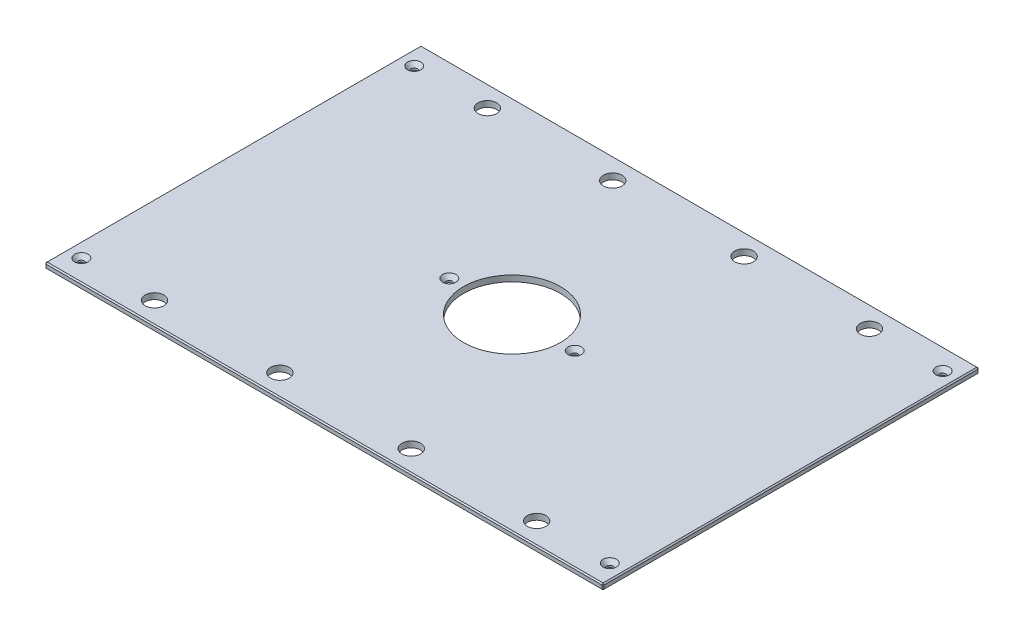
ISO-10303-21;
HEADER;
FILE_DESCRIPTION(('STEP AP214'),'2;1');
FILE_NAME('part.step','',(''),(''),'','','');
FILE_SCHEMA(('AUTOMOTIVE_DESIGN { 1 0 10303 214 1 1 1 1 }'));
ENDSEC;
DATA;
#1=APPLICATION_CONTEXT('core data for automotive mechanical design processes');
#2=APPLICATION_PROTOCOL_DEFINITION('international standard','automotive_design',2000,#1);
#3=PRODUCT_CONTEXT('',#1,'mechanical');
#4=PRODUCT('Part','Part','',(#3));
#5=PRODUCT_RELATED_PRODUCT_CATEGORY('part','',(#4));
#6=PRODUCT_DEFINITION_FORMATION('','',#4);
#7=PRODUCT_DEFINITION_CONTEXT('part definition',#1,'design');
#8=PRODUCT_DEFINITION('design','',#6,#7);
#9=PRODUCT_DEFINITION_SHAPE('','',#8);
#10=(LENGTH_UNIT() NAMED_UNIT(*) SI_UNIT(.MILLI.,.METRE.));
#11=(NAMED_UNIT(*) PLANE_ANGLE_UNIT() SI_UNIT($,.RADIAN.));
#12=(NAMED_UNIT(*) SI_UNIT($,.STERADIAN.) SOLID_ANGLE_UNIT());
#13=UNCERTAINTY_MEASURE_WITH_UNIT(LENGTH_MEASURE(1.E-05),#10,'distance_accuracy_value','');
#14=(GEOMETRIC_REPRESENTATION_CONTEXT(3) GLOBAL_UNCERTAINTY_ASSIGNED_CONTEXT((#13)) GLOBAL_UNIT_ASSIGNED_CONTEXT((#10,
#11,#12)) REPRESENTATION_CONTEXT('',''));
#15=CARTESIAN_POINT('',(0.,0.,0.));
#16=DIRECTION('',(0.,0.,1.));
#17=DIRECTION('',(1.,0.,0.));
#18=AXIS2_PLACEMENT_3D('',#15,#16,#17);
#19=CARTESIAN_POINT('',(-296.8625,6.35,-200.025));
#20=DIRECTION('',(1.,0.,0.));
#21=DIRECTION('',(0.,0.,-1.));
#22=AXIS2_PLACEMENT_3D('',#19,#20,#21);
#23=PLANE('',#22);
#24=DIRECTION('',(0.,0.,-1.));
#25=VECTOR('',#24,1.);
#26=CARTESIAN_POINT('',(-296.8625,5.08000000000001,-200.025));
#27=LINE('',#26,#25);
#28=CARTESIAN_POINT('',(-296.8625,5.08000000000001,198.755));
#29=VERTEX_POINT('',#28);
#30=CARTESIAN_POINT('',(-296.8625,5.08000000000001,-198.755));
#31=VERTEX_POINT('',#30);
#32=EDGE_CURVE('E135',#29,#31,#27,.T.);
#33=ORIENTED_EDGE('',*,*,#32,.T.);
#34=DIRECTION('',(0.,-1.,0.));
#35=VECTOR('',#34,1.);
#36=CARTESIAN_POINT('',(-296.8625,6.35,-198.755));
#37=LINE('',#36,#35);
#38=CARTESIAN_POINT('',(-296.8625,1.26999999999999,-198.755));
#39=VERTEX_POINT('',#38);
#40=EDGE_CURVE('E131',#31,#39,#37,.T.);
#41=ORIENTED_EDGE('',*,*,#40,.T.);
#42=DIRECTION('',(0.,0.,1.));
#43=VECTOR('',#42,1.);
#44=CARTESIAN_POINT('',(-296.8625,1.26999999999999,-200.025));
#45=LINE('',#44,#43);
#46=CARTESIAN_POINT('',(-296.8625,1.26999999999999,198.755));
#47=VERTEX_POINT('',#46);
#48=EDGE_CURVE('E126',#39,#47,#45,.T.);
#49=ORIENTED_EDGE('',*,*,#48,.T.);
#50=DIRECTION('',(0.,1.,0.));
#51=VECTOR('',#50,1.);
#52=CARTESIAN_POINT('',(-296.8625,6.35,198.755));
#53=LINE('',#52,#51);
#54=EDGE_CURVE('E128',#47,#29,#53,.T.);
#55=ORIENTED_EDGE('',*,*,#54,.T.);
#56=EDGE_LOOP('',(#33,#41,#49,#55));
#57=FACE_BOUND('',#56,.T.);
#58=ADVANCED_FACE('F35',(#57),#23,.F.);
#59=CARTESIAN_POINT('',(-296.8625,6.35,200.025));
#60=DIRECTION('',(0.,0.,-1.));
#61=DIRECTION('',(-1.,0.,0.));
#62=AXIS2_PLACEMENT_3D('',#59,#60,#61);
#63=PLANE('',#62);
#64=DIRECTION('',(1.,0.,0.));
#65=VECTOR('',#64,1.);
#66=CARTESIAN_POINT('',(-296.8625,1.26999999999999,200.025));
#67=LINE('',#66,#65);
#68=CARTESIAN_POINT('',(-295.5925,1.26999999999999,200.025));
#69=VERTEX_POINT('',#68);
#70=CARTESIAN_POINT('',(295.5925,1.26999999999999,200.025));
#71=VERTEX_POINT('',#70);
#72=EDGE_CURVE('E58',#69,#71,#67,.T.);
#73=ORIENTED_EDGE('',*,*,#72,.T.);
#74=DIRECTION('',(0.,1.,0.));
#75=VECTOR('',#74,1.);
#76=CARTESIAN_POINT('',(295.5925,6.35,200.025));
#77=LINE('',#76,#75);
#78=CARTESIAN_POINT('',(295.5925,5.08000000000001,200.025));
#79=VERTEX_POINT('',#78);
#80=EDGE_CURVE('E11',#71,#79,#77,.T.);
#81=ORIENTED_EDGE('',*,*,#80,.T.);
#82=DIRECTION('',(-1.,0.,0.));
#83=VECTOR('',#82,1.);
#84=CARTESIAN_POINT('',(-296.8625,5.08000000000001,200.025));
#85=LINE('',#84,#83);
#86=CARTESIAN_POINT('',(-295.5925,5.08000000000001,200.025));
#87=VERTEX_POINT('',#86);
#88=EDGE_CURVE('E44',#79,#87,#85,.T.);
#89=ORIENTED_EDGE('',*,*,#88,.T.);
#90=DIRECTION('',(0.,-1.,0.));
#91=VECTOR('',#90,1.);
#92=CARTESIAN_POINT('',(-295.5925,6.35,200.025));
#93=LINE('',#92,#91);
#94=EDGE_CURVE('E303',#87,#69,#93,.T.);
#95=ORIENTED_EDGE('',*,*,#94,.T.);
#96=EDGE_LOOP('',(#73,#81,#89,#95));
#97=FACE_BOUND('',#96,.T.);
#98=ADVANCED_FACE('F372',(#97),#63,.F.);
#99=CARTESIAN_POINT('',(296.8625,6.35,-200.025));
#100=DIRECTION('',(-1.,0.,0.));
#101=DIRECTION('',(0.,0.,1.));
#102=AXIS2_PLACEMENT_3D('',#99,#100,#101);
#103=PLANE('',#102);
#104=DIRECTION('',(0.,0.,-1.));
#105=VECTOR('',#104,1.);
#106=CARTESIAN_POINT('',(296.8625,1.26999999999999,-200.025));
#107=LINE('',#106,#105);
#108=CARTESIAN_POINT('',(296.8625,1.26999999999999,198.755));
#109=VERTEX_POINT('',#108);
#110=CARTESIAN_POINT('',(296.8625,1.26999999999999,-198.755));
#111=VERTEX_POINT('',#110);
#112=EDGE_CURVE('E298',#109,#111,#107,.T.);
#113=ORIENTED_EDGE('',*,*,#112,.T.);
#114=DIRECTION('',(0.,1.,0.));
#115=VECTOR('',#114,1.);
#116=CARTESIAN_POINT('',(296.8625,6.35,-198.755));
#117=LINE('',#116,#115);
#118=CARTESIAN_POINT('',(296.8625,5.08000000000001,-198.755));
#119=VERTEX_POINT('',#118);
#120=EDGE_CURVE('E300',#111,#119,#117,.T.);
#121=ORIENTED_EDGE('',*,*,#120,.T.);
#122=DIRECTION('',(0.,0.,1.));
#123=VECTOR('',#122,1.);
#124=CARTESIAN_POINT('',(296.8625,5.08000000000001,200.025));
#125=LINE('',#124,#123);
#126=CARTESIAN_POINT('',(296.8625,5.08000000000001,198.755));
#127=VERTEX_POINT('',#126);
#128=EDGE_CURVE('E296',#119,#127,#125,.T.);
#129=ORIENTED_EDGE('',*,*,#128,.T.);
#130=DIRECTION('',(0.,-1.,0.));
#131=VECTOR('',#130,1.);
#132=CARTESIAN_POINT('',(296.8625,6.35,198.755));
#133=LINE('',#132,#131);
#134=EDGE_CURVE('E294',#127,#109,#133,.T.);
#135=ORIENTED_EDGE('',*,*,#134,.T.);
#136=EDGE_LOOP('',(#113,#121,#129,#135));
#137=FACE_BOUND('',#136,.T.);
#138=ADVANCED_FACE('F359',(#137),#103,.F.);
#139=CARTESIAN_POINT('',(-296.8625,6.35,-200.025));
#140=DIRECTION('',(0.,0.,1.));
#141=DIRECTION('',(1.,0.,0.));
#142=AXIS2_PLACEMENT_3D('',#139,#140,#141);
#143=PLANE('',#142);
#144=DIRECTION('',(-1.,0.,0.));
#145=VECTOR('',#144,1.);
#146=CARTESIAN_POINT('',(-296.8625,1.26999999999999,-200.025));
#147=LINE('',#146,#145);
#148=CARTESIAN_POINT('',(295.5925,1.26999999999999,-200.025));
#149=VERTEX_POINT('',#148);
#150=CARTESIAN_POINT('',(-295.5925,1.26999999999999,-200.025));
#151=VERTEX_POINT('',#150);
#152=EDGE_CURVE('E270',#149,#151,#147,.T.);
#153=ORIENTED_EDGE('',*,*,#152,.T.);
#154=DIRECTION('',(0.,1.,0.));
#155=VECTOR('',#154,1.);
#156=CARTESIAN_POINT('',(-295.5925,6.35,-200.025));
#157=LINE('',#156,#155);
#158=CARTESIAN_POINT('',(-295.5925,5.08000000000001,-200.025));
#159=VERTEX_POINT('',#158);
#160=EDGE_CURVE('E274',#151,#159,#157,.T.);
#161=ORIENTED_EDGE('',*,*,#160,.T.);
#162=DIRECTION('',(1.,0.,0.));
#163=VECTOR('',#162,1.);
#164=CARTESIAN_POINT('',(296.8625,5.08000000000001,-200.025));
#165=LINE('',#164,#163);
#166=CARTESIAN_POINT('',(295.5925,5.08000000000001,-200.025));
#167=VERTEX_POINT('',#166);
#168=EDGE_CURVE('E272',#159,#167,#165,.T.);
#169=ORIENTED_EDGE('',*,*,#168,.T.);
#170=DIRECTION('',(0.,-1.,0.));
#171=VECTOR('',#170,1.);
#172=CARTESIAN_POINT('',(295.5925,6.35,-200.025));
#173=LINE('',#172,#171);
#174=EDGE_CURVE('E268',#167,#149,#173,.T.);
#175=ORIENTED_EDGE('',*,*,#174,.T.);
#176=EDGE_LOOP('',(#153,#161,#169,#175));
#177=FACE_BOUND('',#176,.T.);
#178=ADVANCED_FACE('F333',(#177),#143,.F.);
#179=CARTESIAN_POINT('',(0.,6.35,0.));
#180=DIRECTION('',(0.,1.,0.));
#181=DIRECTION('',(0.,0.,1.));
#182=AXIS2_PLACEMENT_3D('',#179,#180,#181);
#183=PLANE('',#182);
#184=CARTESIAN_POINT('',(280.9875,6.35,-177.00498));
#185=DIRECTION('',(0.,1.,0.));
#186=DIRECTION('',(0.,0.,1.));
#187=AXIS2_PLACEMENT_3D('',#184,#185,#186);
#188=CIRCLE('',#187,7.13740000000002);
#189=CARTESIAN_POINT('',(280.9875,6.35,-169.86758));
#190=VERTEX_POINT('',#189);
#191=EDGE_CURVE('E816',#190,#190,#188,.T.);
#192=ORIENTED_EDGE('',*,*,#191,.F.);
#193=EDGE_LOOP('',(#192));
#194=FACE_BOUND('',#193,.T.);
#195=CARTESIAN_POINT('',(280.9875,6.35,177.00498));
#196=DIRECTION('',(0.,1.,0.));
#197=DIRECTION('',(0.,0.,1.));
#198=AXIS2_PLACEMENT_3D('',#195,#196,#197);
#199=CIRCLE('',#198,7.13740000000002);
#200=CARTESIAN_POINT('',(280.9875,6.35,184.14238));
#201=VERTEX_POINT('',#200);
#202=EDGE_CURVE('E820',#201,#201,#199,.T.);
#203=ORIENTED_EDGE('',*,*,#202,.F.);
#204=EDGE_LOOP('',(#203));
#205=FACE_BOUND('',#204,.T.);
#206=CARTESIAN_POINT('',(-280.9875,6.35,177.00498));
#207=DIRECTION('',(0.,1.,0.));
#208=DIRECTION('',(0.,0.,1.));
#209=AXIS2_PLACEMENT_3D('',#206,#207,#208);
#210=CIRCLE('',#209,7.13740000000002);
#211=CARTESIAN_POINT('',(-280.9875,6.35,184.14238));
#212=VERTEX_POINT('',#211);
#213=EDGE_CURVE('E824',#212,#212,#210,.T.);
#214=ORIENTED_EDGE('',*,*,#213,.F.);
#215=EDGE_LOOP('',(#214));
#216=FACE_BOUND('',#215,.T.);
#217=CARTESIAN_POINT('',(-66.675,6.35,0.));
#218=DIRECTION('',(0.,1.,0.));
#219=DIRECTION('',(0.,0.,1.));
#220=AXIS2_PLACEMENT_3D('',#217,#218,#219);
#221=CIRCLE('',#220,7.1374);
#222=CARTESIAN_POINT('',(-66.675,6.35,7.1374));
#223=VERTEX_POINT('',#222);
#224=EDGE_CURVE('E828',#223,#223,#221,.T.);
#225=ORIENTED_EDGE('',*,*,#224,.F.);
#226=EDGE_LOOP('',(#225));
#227=FACE_BOUND('',#226,.T.);
#228=CARTESIAN_POINT('',(66.675,6.35,0.));
#229=DIRECTION('',(0.,1.,0.));
#230=DIRECTION('',(0.,0.,1.));
#231=AXIS2_PLACEMENT_3D('',#228,#229,#230);
#232=CIRCLE('',#231,7.1374);
#233=CARTESIAN_POINT('',(66.675,6.35,7.1374));
#234=VERTEX_POINT('',#233);
#235=EDGE_CURVE('E832',#234,#234,#232,.T.);
#236=ORIENTED_EDGE('',*,*,#235,.F.);
#237=EDGE_LOOP('',(#236));
#238=FACE_BOUND('',#237,.T.);
#239=CARTESIAN_POINT('',(-280.9875,6.35,-177.00498));
#240=DIRECTION('',(0.,1.,0.));
#241=DIRECTION('',(0.,0.,1.));
#242=AXIS2_PLACEMENT_3D('',#239,#240,#241);
#243=CIRCLE('',#242,7.13740000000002);
#244=CARTESIAN_POINT('',(-280.9875,6.35,-169.86758));
#245=VERTEX_POINT('',#244);
#246=EDGE_CURVE('E835',#245,#245,#243,.T.);
#247=ORIENTED_EDGE('',*,*,#246,.F.);
#248=EDGE_LOOP('',(#247));
#249=FACE_BOUND('',#248,.T.);
#250=DIRECTION('',(0.,0.,-1.));
#251=VECTOR('',#250,1.);
#252=CARTESIAN_POINT('',(295.5925,6.35,-200.025));
#253=LINE('',#252,#251);
#254=CARTESIAN_POINT('',(295.5925,6.35,198.755));
#255=VERTEX_POINT('',#254);
#256=CARTESIAN_POINT('',(295.5925,6.35,-198.755));
#257=VERTEX_POINT('',#256);
#258=EDGE_CURVE('E281',#255,#257,#253,.T.);
#259=ORIENTED_EDGE('',*,*,#258,.T.);
#260=DIRECTION('',(-1.,0.,0.));
#261=VECTOR('',#260,1.);
#262=CARTESIAN_POINT('',(-296.8625,6.35,-198.755));
#263=LINE('',#262,#261);
#264=CARTESIAN_POINT('',(-295.5925,6.35,-198.755));
#265=VERTEX_POINT('',#264);
#266=EDGE_CURVE('E283',#257,#265,#263,.T.);
#267=ORIENTED_EDGE('',*,*,#266,.T.);
#268=DIRECTION('',(0.,0.,1.));
#269=VECTOR('',#268,1.);
#270=CARTESIAN_POINT('',(-295.5925,6.35,200.025));
#271=LINE('',#270,#269);
#272=CARTESIAN_POINT('',(-295.5925,6.35,198.755));
#273=VERTEX_POINT('',#272);
#274=EDGE_CURVE('E279',#265,#273,#271,.T.);
#275=ORIENTED_EDGE('',*,*,#274,.T.);
#276=DIRECTION('',(1.,0.,0.));
#277=VECTOR('',#276,1.);
#278=CARTESIAN_POINT('',(296.8625,6.35,198.755));
#279=LINE('',#278,#277);
#280=EDGE_CURVE('E277',#273,#255,#279,.T.);
#281=ORIENTED_EDGE('',*,*,#280,.T.);
#282=EDGE_LOOP('',(#259,#267,#275,#281));
#283=FACE_BOUND('',#282,.T.);
#284=CARTESIAN_POINT('',(203.2,6.35,-177.00498));
#285=DIRECTION('',(0.,1.,0.));
#286=DIRECTION('',(0.,0.,1.));
#287=AXIS2_PLACEMENT_3D('',#284,#285,#286);
#288=CIRCLE('',#287,9.921875);
#289=CARTESIAN_POINT('',(203.2,6.35,-167.083105));
#290=VERTEX_POINT('',#289);
#291=EDGE_CURVE('E204',#290,#290,#288,.T.);
#292=ORIENTED_EDGE('',*,*,#291,.F.);
#293=EDGE_LOOP('',(#292));
#294=FACE_BOUND('',#293,.T.);
#295=CARTESIAN_POINT('',(-203.2,6.35,-177.00498));
#296=DIRECTION('',(0.,1.,0.));
#297=DIRECTION('',(0.,0.,1.));
#298=AXIS2_PLACEMENT_3D('',#295,#296,#297);
#299=CIRCLE('',#298,9.921875);
#300=CARTESIAN_POINT('',(-203.2,6.35,-167.083105));
#301=VERTEX_POINT('',#300);
#302=EDGE_CURVE('E214',#301,#301,#299,.T.);
#303=ORIENTED_EDGE('',*,*,#302,.F.);
#304=EDGE_LOOP('',(#303));
#305=FACE_BOUND('',#304,.T.);
#306=CARTESIAN_POINT('',(203.2,6.35,177.00498));
#307=DIRECTION('',(0.,1.,0.));
#308=DIRECTION('',(0.,0.,1.));
#309=AXIS2_PLACEMENT_3D('',#306,#307,#308);
#310=CIRCLE('',#309,9.921875);
#311=CARTESIAN_POINT('',(203.2,6.35,186.926855));
#312=VERTEX_POINT('',#311);
#313=EDGE_CURVE('E225',#312,#312,#310,.T.);
#314=ORIENTED_EDGE('',*,*,#313,.F.);
#315=EDGE_LOOP('',(#314));
#316=FACE_BOUND('',#315,.T.);
#317=CARTESIAN_POINT('',(-203.2,6.35,177.00498));
#318=DIRECTION('',(0.,1.,0.));
#319=DIRECTION('',(0.,0.,1.));
#320=AXIS2_PLACEMENT_3D('',#317,#318,#319);
#321=CIRCLE('',#320,9.921875);
#322=CARTESIAN_POINT('',(-203.2,6.35,186.926855));
#323=VERTEX_POINT('',#322);
#324=EDGE_CURVE('E231',#323,#323,#321,.T.);
#325=ORIENTED_EDGE('',*,*,#324,.F.);
#326=EDGE_LOOP('',(#325));
#327=FACE_BOUND('',#326,.T.);
#328=CARTESIAN_POINT('',(-69.85,6.35,-177.00498));
#329=DIRECTION('',(0.,1.,0.));
#330=DIRECTION('',(0.,0.,1.));
#331=AXIS2_PLACEMENT_3D('',#328,#329,#330);
#332=CIRCLE('',#331,9.921875);
#333=CARTESIAN_POINT('',(-69.85,6.35,-167.083105));
#334=VERTEX_POINT('',#333);
#335=EDGE_CURVE('E237',#334,#334,#332,.T.);
#336=ORIENTED_EDGE('',*,*,#335,.F.);
#337=EDGE_LOOP('',(#336));
#338=FACE_BOUND('',#337,.T.);
#339=CARTESIAN_POINT('',(69.85,6.35,-177.00498));
#340=DIRECTION('',(0.,1.,0.));
#341=DIRECTION('',(0.,0.,1.));
#342=AXIS2_PLACEMENT_3D('',#339,#340,#341);
#343=CIRCLE('',#342,9.921875);
#344=CARTESIAN_POINT('',(69.85,6.35,-167.083105));
#345=VERTEX_POINT('',#344);
#346=EDGE_CURVE('E243',#345,#345,#343,.T.);
#347=ORIENTED_EDGE('',*,*,#346,.F.);
#348=EDGE_LOOP('',(#347));
#349=FACE_BOUND('',#348,.T.);
#350=CARTESIAN_POINT('',(69.85,6.35,177.00498));
#351=DIRECTION('',(0.,1.,0.));
#352=DIRECTION('',(0.,0.,1.));
#353=AXIS2_PLACEMENT_3D('',#350,#351,#352);
#354=CIRCLE('',#353,9.921875);
#355=CARTESIAN_POINT('',(69.85,6.35,186.926855));
#356=VERTEX_POINT('',#355);
#357=EDGE_CURVE('E249',#356,#356,#354,.T.);
#358=ORIENTED_EDGE('',*,*,#357,.F.);
#359=EDGE_LOOP('',(#358));
#360=FACE_BOUND('',#359,.T.);
#361=CARTESIAN_POINT('',(-69.85,6.35,177.00498));
#362=DIRECTION('',(0.,1.,0.));
#363=DIRECTION('',(0.,0.,1.));
#364=AXIS2_PLACEMENT_3D('',#361,#362,#363);
#365=CIRCLE('',#364,9.921875);
#366=CARTESIAN_POINT('',(-69.85,6.35,186.926855));
#367=VERTEX_POINT('',#366);
#368=EDGE_CURVE('E255',#367,#367,#365,.T.);
#369=ORIENTED_EDGE('',*,*,#368,.F.);
#370=EDGE_LOOP('',(#369));
#371=FACE_BOUND('',#370,.T.);
#372=CARTESIAN_POINT('',(0.,6.35,0.));
#373=DIRECTION('',(0.,1.,0.));
#374=DIRECTION('',(0.,0.,1.));
#375=AXIS2_PLACEMENT_3D('',#372,#373,#374);
#376=CIRCLE('',#375,51.562);
#377=CARTESIAN_POINT('',(0.,6.35,51.562));
#378=VERTEX_POINT('',#377);
#379=EDGE_CURVE('E261',#378,#378,#376,.T.);
#380=ORIENTED_EDGE('',*,*,#379,.F.);
#381=EDGE_LOOP('',(#380));
#382=FACE_BOUND('',#381,.T.);
#383=ADVANCED_FACE('F381',(#194,#205,#216,#227,#238,#249,#283,#294,#305,#316,#327,#338,#349,
#360,#371,#382),#183,.T.);
#384=CARTESIAN_POINT('',(0.,0.,0.));
#385=DIRECTION('',(0.,1.,0.));
#386=DIRECTION('',(0.,0.,1.));
#387=AXIS2_PLACEMENT_3D('',#384,#385,#386);
#388=PLANE('',#387);
#389=CARTESIAN_POINT('',(280.9875,0.,-177.00498));
#390=DIRECTION('',(0.,1.,0.));
#391=DIRECTION('',(0.,0.,1.));
#392=AXIS2_PLACEMENT_3D('',#389,#390,#391);
#393=CIRCLE('',#392,3.3782);
#394=CARTESIAN_POINT('',(280.9875,0.,-173.62678));
#395=VERTEX_POINT('',#394);
#396=EDGE_CURVE('E869',#395,#395,#393,.T.);
#397=ORIENTED_EDGE('',*,*,#396,.T.);
#398=EDGE_LOOP('',(#397));
#399=FACE_BOUND('',#398,.T.);
#400=CARTESIAN_POINT('',(280.9875,0.,177.00498));
#401=DIRECTION('',(0.,1.,0.));
#402=DIRECTION('',(0.,0.,1.));
#403=AXIS2_PLACEMENT_3D('',#400,#401,#402);
#404=CIRCLE('',#403,3.3782);
#405=CARTESIAN_POINT('',(280.9875,0.,180.38318));
#406=VERTEX_POINT('',#405);
#407=EDGE_CURVE('E862',#406,#406,#404,.T.);
#408=ORIENTED_EDGE('',*,*,#407,.T.);
#409=EDGE_LOOP('',(#408));
#410=FACE_BOUND('',#409,.T.);
#411=CARTESIAN_POINT('',(-280.9875,0.,177.00498));
#412=DIRECTION('',(0.,1.,0.));
#413=DIRECTION('',(0.,0.,1.));
#414=AXIS2_PLACEMENT_3D('',#411,#412,#413);
#415=CIRCLE('',#414,3.3782);
#416=CARTESIAN_POINT('',(-280.9875,0.,180.38318));
#417=VERTEX_POINT('',#416);
#418=EDGE_CURVE('E855',#417,#417,#415,.T.);
#419=ORIENTED_EDGE('',*,*,#418,.T.);
#420=EDGE_LOOP('',(#419));
#421=FACE_BOUND('',#420,.T.);
#422=CARTESIAN_POINT('',(-66.675,0.,0.));
#423=DIRECTION('',(0.,1.,0.));
#424=DIRECTION('',(0.,0.,1.));
#425=AXIS2_PLACEMENT_3D('',#422,#423,#424);
#426=CIRCLE('',#425,3.3782);
#427=CARTESIAN_POINT('',(-66.675,0.,3.3782));
#428=VERTEX_POINT('',#427);
#429=EDGE_CURVE('E848',#428,#428,#426,.T.);
#430=ORIENTED_EDGE('',*,*,#429,.T.);
#431=EDGE_LOOP('',(#430));
#432=FACE_BOUND('',#431,.T.);
#433=CARTESIAN_POINT('',(66.675,0.,0.));
#434=DIRECTION('',(0.,1.,0.));
#435=DIRECTION('',(0.,0.,1.));
#436=AXIS2_PLACEMENT_3D('',#433,#434,#435);
#437=CIRCLE('',#436,3.3782);
#438=CARTESIAN_POINT('',(66.675,0.,3.3782));
#439=VERTEX_POINT('',#438);
#440=EDGE_CURVE('E838',#439,#439,#437,.T.);
#441=ORIENTED_EDGE('',*,*,#440,.T.);
#442=EDGE_LOOP('',(#441));
#443=FACE_BOUND('',#442,.T.);
#444=CARTESIAN_POINT('',(-280.9875,0.,-177.00498));
#445=DIRECTION('',(0.,1.,0.));
#446=DIRECTION('',(0.,0.,1.));
#447=AXIS2_PLACEMENT_3D('',#444,#445,#446);
#448=CIRCLE('',#447,3.3782);
#449=CARTESIAN_POINT('',(-280.9875,0.,-173.62678));
#450=VERTEX_POINT('',#449);
#451=EDGE_CURVE('E217',#450,#450,#448,.T.);
#452=ORIENTED_EDGE('',*,*,#451,.T.);
#453=EDGE_LOOP('',(#452));
#454=FACE_BOUND('',#453,.T.);
#455=DIRECTION('',(0.,0.,-1.));
#456=VECTOR('',#455,1.);
#457=CARTESIAN_POINT('',(-295.5925,0.,0.));
#458=LINE('',#457,#456);
#459=CARTESIAN_POINT('',(-295.5925,0.,198.755));
#460=VERTEX_POINT('',#459);
#461=CARTESIAN_POINT('',(-295.5925,0.,-198.755));
#462=VERTEX_POINT('',#461);
#463=EDGE_CURVE('E158',#460,#462,#458,.T.);
#464=ORIENTED_EDGE('',*,*,#463,.T.);
#465=DIRECTION('',(1.,0.,0.));
#466=VECTOR('',#465,1.);
#467=CARTESIAN_POINT('',(0.,0.,-198.755));
#468=LINE('',#467,#466);
#469=CARTESIAN_POINT('',(295.5925,0.,-198.755));
#470=VERTEX_POINT('',#469);
#471=EDGE_CURVE('E291',#462,#470,#468,.T.);
#472=ORIENTED_EDGE('',*,*,#471,.T.);
#473=DIRECTION('',(0.,0.,1.));
#474=VECTOR('',#473,1.);
#475=CARTESIAN_POINT('',(295.5925,0.,0.));
#476=LINE('',#475,#474);
#477=CARTESIAN_POINT('',(295.5925,0.,198.755));
#478=VERTEX_POINT('',#477);
#479=EDGE_CURVE('E289',#470,#478,#476,.T.);
#480=ORIENTED_EDGE('',*,*,#479,.T.);
#481=DIRECTION('',(-1.,0.,0.));
#482=VECTOR('',#481,1.);
#483=CARTESIAN_POINT('',(0.,0.,198.755));
#484=LINE('',#483,#482);
#485=EDGE_CURVE('E286',#478,#460,#484,.T.);
#486=ORIENTED_EDGE('',*,*,#485,.T.);
#487=EDGE_LOOP('',(#464,#472,#480,#486));
#488=FACE_BOUND('',#487,.T.);
#489=CARTESIAN_POINT('',(203.2,0.,-177.00498));
#490=DIRECTION('',(0.,1.,0.));
#491=DIRECTION('',(0.,0.,1.));
#492=AXIS2_PLACEMENT_3D('',#489,#490,#491);
#493=CIRCLE('',#492,9.921875);
#494=CARTESIAN_POINT('',(203.2,0.,-167.083105));
#495=VERTEX_POINT('',#494);
#496=EDGE_CURVE('E209',#495,#495,#493,.T.);
#497=ORIENTED_EDGE('',*,*,#496,.T.);
#498=EDGE_LOOP('',(#497));
#499=FACE_BOUND('',#498,.T.);
#500=CARTESIAN_POINT('',(-203.2,0.,-177.00498));
#501=DIRECTION('',(0.,1.,0.));
#502=DIRECTION('',(0.,0.,1.));
#503=AXIS2_PLACEMENT_3D('',#500,#501,#502);
#504=CIRCLE('',#503,9.921875);
#505=CARTESIAN_POINT('',(-203.2,0.,-167.083105));
#506=VERTEX_POINT('',#505);
#507=EDGE_CURVE('E222',#506,#506,#504,.T.);
#508=ORIENTED_EDGE('',*,*,#507,.T.);
#509=EDGE_LOOP('',(#508));
#510=FACE_BOUND('',#509,.T.);
#511=CARTESIAN_POINT('',(203.2,0.,177.00498));
#512=DIRECTION('',(0.,1.,0.));
#513=DIRECTION('',(0.,0.,1.));
#514=AXIS2_PLACEMENT_3D('',#511,#512,#513);
#515=CIRCLE('',#514,9.921875);
#516=CARTESIAN_POINT('',(203.2,0.,186.926855));
#517=VERTEX_POINT('',#516);
#518=EDGE_CURVE('E228',#517,#517,#515,.T.);
#519=ORIENTED_EDGE('',*,*,#518,.T.);
#520=EDGE_LOOP('',(#519));
#521=FACE_BOUND('',#520,.T.);
#522=CARTESIAN_POINT('',(-203.2,0.,177.00498));
#523=DIRECTION('',(0.,1.,0.));
#524=DIRECTION('',(0.,0.,1.));
#525=AXIS2_PLACEMENT_3D('',#522,#523,#524);
#526=CIRCLE('',#525,9.921875);
#527=CARTESIAN_POINT('',(-203.2,0.,186.926855));
#528=VERTEX_POINT('',#527);
#529=EDGE_CURVE('E234',#528,#528,#526,.T.);
#530=ORIENTED_EDGE('',*,*,#529,.T.);
#531=EDGE_LOOP('',(#530));
#532=FACE_BOUND('',#531,.T.);
#533=CARTESIAN_POINT('',(-69.85,0.,-177.00498));
#534=DIRECTION('',(0.,1.,0.));
#535=DIRECTION('',(0.,0.,1.));
#536=AXIS2_PLACEMENT_3D('',#533,#534,#535);
#537=CIRCLE('',#536,9.921875);
#538=CARTESIAN_POINT('',(-69.85,0.,-167.083105));
#539=VERTEX_POINT('',#538);
#540=EDGE_CURVE('E240',#539,#539,#537,.T.);
#541=ORIENTED_EDGE('',*,*,#540,.T.);
#542=EDGE_LOOP('',(#541));
#543=FACE_BOUND('',#542,.T.);
#544=CARTESIAN_POINT('',(69.85,0.,-177.00498));
#545=DIRECTION('',(0.,1.,0.));
#546=DIRECTION('',(0.,0.,1.));
#547=AXIS2_PLACEMENT_3D('',#544,#545,#546);
#548=CIRCLE('',#547,9.921875);
#549=CARTESIAN_POINT('',(69.85,0.,-167.083105));
#550=VERTEX_POINT('',#549);
#551=EDGE_CURVE('E246',#550,#550,#548,.T.);
#552=ORIENTED_EDGE('',*,*,#551,.T.);
#553=EDGE_LOOP('',(#552));
#554=FACE_BOUND('',#553,.T.);
#555=CARTESIAN_POINT('',(69.85,0.,177.00498));
#556=DIRECTION('',(0.,1.,0.));
#557=DIRECTION('',(0.,0.,1.));
#558=AXIS2_PLACEMENT_3D('',#555,#556,#557);
#559=CIRCLE('',#558,9.921875);
#560=CARTESIAN_POINT('',(69.85,0.,186.926855));
#561=VERTEX_POINT('',#560);
#562=EDGE_CURVE('E252',#561,#561,#559,.T.);
#563=ORIENTED_EDGE('',*,*,#562,.T.);
#564=EDGE_LOOP('',(#563));
#565=FACE_BOUND('',#564,.T.);
#566=CARTESIAN_POINT('',(-69.85,0.,177.00498));
#567=DIRECTION('',(0.,1.,0.));
#568=DIRECTION('',(0.,0.,1.));
#569=AXIS2_PLACEMENT_3D('',#566,#567,#568);
#570=CIRCLE('',#569,9.921875);
#571=CARTESIAN_POINT('',(-69.85,0.,186.926855));
#572=VERTEX_POINT('',#571);
#573=EDGE_CURVE('E258',#572,#572,#570,.T.);
#574=ORIENTED_EDGE('',*,*,#573,.T.);
#575=EDGE_LOOP('',(#574));
#576=FACE_BOUND('',#575,.T.);
#577=CARTESIAN_POINT('',(0.,0.,0.));
#578=DIRECTION('',(0.,1.,0.));
#579=DIRECTION('',(0.,0.,1.));
#580=AXIS2_PLACEMENT_3D('',#577,#578,#579);
#581=CIRCLE('',#580,51.562);
#582=CARTESIAN_POINT('',(0.,0.,51.562));
#583=VERTEX_POINT('',#582);
#584=EDGE_CURVE('E147',#583,#583,#581,.T.);
#585=ORIENTED_EDGE('',*,*,#584,.T.);
#586=EDGE_LOOP('',(#585));
#587=FACE_BOUND('',#586,.T.);
#588=ADVANCED_FACE('F346',(#399,#410,#421,#432,#443,#454,#488,#499,#510,#521,#532,#543,#554,
#565,#576,#587),#388,.F.);
#589=CARTESIAN_POINT('',(0.,0.,0.));
#590=DIRECTION('',(0.,1.,0.));
#591=DIRECTION('',(0.,0.,1.));
#592=AXIS2_PLACEMENT_3D('',#589,#590,#591);
#593=CYLINDRICAL_SURFACE('',#592,51.562);
#594=ORIENTED_EDGE('',*,*,#584,.F.);
#595=EDGE_LOOP('',(#594));
#596=FACE_BOUND('',#595,.T.);
#597=ORIENTED_EDGE('',*,*,#379,.T.);
#598=EDGE_LOOP('',(#597));
#599=FACE_BOUND('',#598,.T.);
#600=ADVANCED_FACE('F751',(#596,#599),#593,.F.);
#601=CARTESIAN_POINT('',(-69.85,6.35,177.00498));
#602=DIRECTION('',(0.,1.,0.));
#603=DIRECTION('',(0.,0.,1.));
#604=AXIS2_PLACEMENT_3D('',#601,#602,#603);
#605=CYLINDRICAL_SURFACE('',#604,9.921875);
#606=ORIENTED_EDGE('',*,*,#573,.F.);
#607=EDGE_LOOP('',(#606));
#608=FACE_BOUND('',#607,.T.);
#609=ORIENTED_EDGE('',*,*,#368,.T.);
#610=EDGE_LOOP('',(#609));
#611=FACE_BOUND('',#610,.T.);
#612=ADVANCED_FACE('F742',(#608,#611),#605,.F.);
#613=CARTESIAN_POINT('',(69.85,6.35,177.00498));
#614=DIRECTION('',(0.,1.,0.));
#615=DIRECTION('',(0.,0.,1.));
#616=AXIS2_PLACEMENT_3D('',#613,#614,#615);
#617=CYLINDRICAL_SURFACE('',#616,9.921875);
#618=ORIENTED_EDGE('',*,*,#562,.F.);
#619=EDGE_LOOP('',(#618));
#620=FACE_BOUND('',#619,.T.);
#621=ORIENTED_EDGE('',*,*,#357,.T.);
#622=EDGE_LOOP('',(#621));
#623=FACE_BOUND('',#622,.T.);
#624=ADVANCED_FACE('F733',(#620,#623),#617,.F.);
#625=CARTESIAN_POINT('',(69.85,6.35,-177.00498));
#626=DIRECTION('',(0.,1.,0.));
#627=DIRECTION('',(0.,0.,1.));
#628=AXIS2_PLACEMENT_3D('',#625,#626,#627);
#629=CYLINDRICAL_SURFACE('',#628,9.921875);
#630=ORIENTED_EDGE('',*,*,#551,.F.);
#631=EDGE_LOOP('',(#630));
#632=FACE_BOUND('',#631,.T.);
#633=ORIENTED_EDGE('',*,*,#346,.T.);
#634=EDGE_LOOP('',(#633));
#635=FACE_BOUND('',#634,.T.);
#636=ADVANCED_FACE('F724',(#632,#635),#629,.F.);
#637=CARTESIAN_POINT('',(-69.85,6.35,-177.00498));
#638=DIRECTION('',(0.,1.,0.));
#639=DIRECTION('',(0.,0.,1.));
#640=AXIS2_PLACEMENT_3D('',#637,#638,#639);
#641=CYLINDRICAL_SURFACE('',#640,9.921875);
#642=ORIENTED_EDGE('',*,*,#540,.F.);
#643=EDGE_LOOP('',(#642));
#644=FACE_BOUND('',#643,.T.);
#645=ORIENTED_EDGE('',*,*,#335,.T.);
#646=EDGE_LOOP('',(#645));
#647=FACE_BOUND('',#646,.T.);
#648=ADVANCED_FACE('F715',(#644,#647),#641,.F.);
#649=CARTESIAN_POINT('',(-203.2,6.35,177.00498));
#650=DIRECTION('',(0.,1.,0.));
#651=DIRECTION('',(0.,0.,1.));
#652=AXIS2_PLACEMENT_3D('',#649,#650,#651);
#653=CYLINDRICAL_SURFACE('',#652,9.921875);
#654=ORIENTED_EDGE('',*,*,#529,.F.);
#655=EDGE_LOOP('',(#654));
#656=FACE_BOUND('',#655,.T.);
#657=ORIENTED_EDGE('',*,*,#324,.T.);
#658=EDGE_LOOP('',(#657));
#659=FACE_BOUND('',#658,.T.);
#660=ADVANCED_FACE('F706',(#656,#659),#653,.F.);
#661=CARTESIAN_POINT('',(203.2,6.35,177.00498));
#662=DIRECTION('',(0.,1.,0.));
#663=DIRECTION('',(0.,0.,1.));
#664=AXIS2_PLACEMENT_3D('',#661,#662,#663);
#665=CYLINDRICAL_SURFACE('',#664,9.921875);
#666=ORIENTED_EDGE('',*,*,#518,.F.);
#667=EDGE_LOOP('',(#666));
#668=FACE_BOUND('',#667,.T.);
#669=ORIENTED_EDGE('',*,*,#313,.T.);
#670=EDGE_LOOP('',(#669));
#671=FACE_BOUND('',#670,.T.);
#672=ADVANCED_FACE('F697',(#668,#671),#665,.F.);
#673=CARTESIAN_POINT('',(-203.2,6.35,-177.00498));
#674=DIRECTION('',(0.,1.,0.));
#675=DIRECTION('',(0.,0.,1.));
#676=AXIS2_PLACEMENT_3D('',#673,#674,#675);
#677=CYLINDRICAL_SURFACE('',#676,9.921875);
#678=ORIENTED_EDGE('',*,*,#507,.F.);
#679=EDGE_LOOP('',(#678));
#680=FACE_BOUND('',#679,.T.);
#681=ORIENTED_EDGE('',*,*,#302,.T.);
#682=EDGE_LOOP('',(#681));
#683=FACE_BOUND('',#682,.T.);
#684=ADVANCED_FACE('F687',(#680,#683),#677,.F.);
#685=CARTESIAN_POINT('',(203.2,6.35,-177.00498));
#686=DIRECTION('',(0.,1.,0.));
#687=DIRECTION('',(0.,0.,1.));
#688=AXIS2_PLACEMENT_3D('',#685,#686,#687);
#689=CYLINDRICAL_SURFACE('',#688,9.921875);
#690=ORIENTED_EDGE('',*,*,#496,.F.);
#691=EDGE_LOOP('',(#690));
#692=FACE_BOUND('',#691,.T.);
#693=ORIENTED_EDGE('',*,*,#291,.T.);
#694=EDGE_LOOP('',(#693));
#695=FACE_BOUND('',#694,.T.);
#696=ADVANCED_FACE('F390',(#692,#695),#689,.F.);
#697=CARTESIAN_POINT('',(296.8625,6.35,198.755));
#698=DIRECTION('',(-0.707106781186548,0.,-0.707106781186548));
#699=DIRECTION('',(0.,-1.,0.));
#700=AXIS2_PLACEMENT_3D('',#697,#698,#699);
#701=PLANE('',#700);
#702=DIRECTION('',(-0.707106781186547,0.,0.707106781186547));
#703=VECTOR('',#702,1.);
#704=CARTESIAN_POINT('',(296.8625,5.08000000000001,198.755));
#705=LINE('',#704,#703);
#706=EDGE_CURVE('E39',#79,#127,#705,.F.);
#707=ORIENTED_EDGE('',*,*,#706,.F.);
#708=ORIENTED_EDGE('',*,*,#80,.F.);
#709=DIRECTION('',(0.707106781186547,0.,-0.707106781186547));
#710=VECTOR('',#709,1.);
#711=CARTESIAN_POINT('',(296.2275,1.26999999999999,199.39));
#712=LINE('',#711,#710);
#713=EDGE_CURVE('E197',#109,#71,#712,.F.);
#714=ORIENTED_EDGE('',*,*,#713,.F.);
#715=ORIENTED_EDGE('',*,*,#134,.F.);
#716=EDGE_LOOP('',(#707,#708,#714,#715));
#717=FACE_BOUND('',#716,.T.);
#718=ADVANCED_FACE('F37',(#717),#701,.F.);
#719=CARTESIAN_POINT('',(296.8625,5.08000000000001,198.755));
#720=DIRECTION('',(0.577350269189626,0.577350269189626,0.577350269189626));
#721=DIRECTION('',(0.707106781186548,0.,-0.707106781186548));
#722=AXIS2_PLACEMENT_3D('',#719,#720,#721);
#723=PLANE('',#722);
#724=DIRECTION('',(0.,-0.707106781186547,0.707106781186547));
#725=VECTOR('',#724,1.);
#726=CARTESIAN_POINT('',(295.5925,5.715,199.39));
#727=LINE('',#726,#725);
#728=EDGE_CURVE('E193',#79,#255,#727,.F.);
#729=ORIENTED_EDGE('',*,*,#728,.F.);
#730=ORIENTED_EDGE('',*,*,#706,.T.);
#731=DIRECTION('',(-0.707106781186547,0.707106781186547,0.));
#732=VECTOR('',#731,1.);
#733=CARTESIAN_POINT('',(296.8625,5.08000000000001,198.755));
#734=LINE('',#733,#732);
#735=EDGE_CURVE('E195',#255,#127,#734,.F.);
#736=ORIENTED_EDGE('',*,*,#735,.F.);
#737=EDGE_LOOP('',(#729,#730,#736));
#738=FACE_BOUND('',#737,.T.);
#739=ADVANCED_FACE('F383',(#738),#723,.T.);
#740=CARTESIAN_POINT('',(295.5925,0.,198.755));
#741=DIRECTION('',(0.577350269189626,-0.577350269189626,0.577350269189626));
#742=DIRECTION('',(0.707106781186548,0.,-0.707106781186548));
#743=AXIS2_PLACEMENT_3D('',#740,#741,#742);
#744=PLANE('',#743);
#745=DIRECTION('',(-0.707106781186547,-0.707106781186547,0.));
#746=VECTOR('',#745,1.);
#747=CARTESIAN_POINT('',(295.5925,0.,198.755));
#748=LINE('',#747,#746);
#749=EDGE_CURVE('E187',#109,#478,#748,.T.);
#750=ORIENTED_EDGE('',*,*,#749,.F.);
#751=ORIENTED_EDGE('',*,*,#713,.T.);
#752=DIRECTION('',(0.,0.707106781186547,0.707106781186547));
#753=VECTOR('',#752,1.);
#754=CARTESIAN_POINT('',(295.5925,0.,198.755));
#755=LINE('',#754,#753);
#756=EDGE_CURVE('E190',#478,#71,#755,.T.);
#757=ORIENTED_EDGE('',*,*,#756,.F.);
#758=EDGE_LOOP('',(#750,#751,#757));
#759=FACE_BOUND('',#758,.T.);
#760=ADVANCED_FACE('F352',(#759),#744,.T.);
#761=CARTESIAN_POINT('',(295.5925,6.35,0.));
#762=DIRECTION('',(0.707106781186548,0.707106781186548,0.));
#763=DIRECTION('',(0.,0.,1.));
#764=AXIS2_PLACEMENT_3D('',#761,#762,#763);
#765=PLANE('',#764);
#766=ORIENTED_EDGE('',*,*,#735,.T.);
#767=ORIENTED_EDGE('',*,*,#128,.F.);
#768=DIRECTION('',(0.707106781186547,-0.707106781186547,0.));
#769=VECTOR('',#768,1.);
#770=CARTESIAN_POINT('',(296.2275,5.715,-198.755));
#771=LINE('',#770,#769);
#772=EDGE_CURVE('E182',#257,#119,#771,.T.);
#773=ORIENTED_EDGE('',*,*,#772,.F.);
#774=ORIENTED_EDGE('',*,*,#258,.F.);
#775=EDGE_LOOP('',(#766,#767,#773,#774));
#776=FACE_BOUND('',#775,.T.);
#777=ADVANCED_FACE('F369',(#776),#765,.T.);
#778=CARTESIAN_POINT('',(0.,6.35,198.755));
#779=DIRECTION('',(0.,0.707106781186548,0.707106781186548));
#780=DIRECTION('',(-1.,0.,0.));
#781=AXIS2_PLACEMENT_3D('',#778,#779,#780);
#782=PLANE('',#781);
#783=ORIENTED_EDGE('',*,*,#728,.T.);
#784=ORIENTED_EDGE('',*,*,#280,.F.);
#785=DIRECTION('',(0.,0.707106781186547,-0.707106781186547));
#786=VECTOR('',#785,1.);
#787=CARTESIAN_POINT('',(-295.5925,6.35,198.755));
#788=LINE('',#787,#786);
#789=EDGE_CURVE('E179',#87,#273,#788,.T.);
#790=ORIENTED_EDGE('',*,*,#789,.F.);
#791=ORIENTED_EDGE('',*,*,#88,.F.);
#792=EDGE_LOOP('',(#783,#784,#790,#791));
#793=FACE_BOUND('',#792,.T.);
#794=ADVANCED_FACE('F374',(#793),#782,.T.);
#795=CARTESIAN_POINT('',(-295.5925,6.35,200.025));
#796=DIRECTION('',(0.707106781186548,0.,-0.707106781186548));
#797=DIRECTION('',(0.,-1.,0.));
#798=AXIS2_PLACEMENT_3D('',#795,#796,#797);
#799=PLANE('',#798);
#800=DIRECTION('',(0.707106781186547,0.,0.707106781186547));
#801=VECTOR('',#800,1.);
#802=CARTESIAN_POINT('',(-296.8625,1.26999999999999,198.755));
#803=LINE('',#802,#801);
#804=EDGE_CURVE('E142',#69,#47,#803,.F.);
#805=ORIENTED_EDGE('',*,*,#804,.F.);
#806=ORIENTED_EDGE('',*,*,#94,.F.);
#807=DIRECTION('',(-0.707106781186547,0.,-0.707106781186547));
#808=VECTOR('',#807,1.);
#809=CARTESIAN_POINT('',(-296.2275,5.08000000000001,199.39));
#810=LINE('',#809,#808);
#811=EDGE_CURVE('E145',#29,#87,#810,.F.);
#812=ORIENTED_EDGE('',*,*,#811,.F.);
#813=ORIENTED_EDGE('',*,*,#54,.F.);
#814=EDGE_LOOP('',(#805,#806,#812,#813));
#815=FACE_BOUND('',#814,.T.);
#816=ADVANCED_FACE('F140',(#815),#799,.F.);
#817=CARTESIAN_POINT('',(-296.8625,1.26999999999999,200.025));
#818=DIRECTION('',(0.,0.707106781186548,-0.707106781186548));
#819=DIRECTION('',(1.,0.,0.));
#820=AXIS2_PLACEMENT_3D('',#817,#818,#819);
#821=PLANE('',#820);
#822=ORIENTED_EDGE('',*,*,#756,.T.);
#823=ORIENTED_EDGE('',*,*,#72,.F.);
#824=DIRECTION('',(0.,-0.707106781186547,-0.707106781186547));
#825=VECTOR('',#824,1.);
#826=CARTESIAN_POINT('',(-295.5925,0.634999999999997,199.39));
#827=LINE('',#826,#825);
#828=EDGE_CURVE('E155',#460,#69,#827,.F.);
#829=ORIENTED_EDGE('',*,*,#828,.F.);
#830=ORIENTED_EDGE('',*,*,#485,.F.);
#831=EDGE_LOOP('',(#822,#823,#829,#830));
#832=FACE_BOUND('',#831,.T.);
#833=ADVANCED_FACE('F351',(#832),#821,.F.);
#834=CARTESIAN_POINT('',(296.8625,1.26999999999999,-200.025));
#835=DIRECTION('',(-0.707106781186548,0.707106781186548,0.));
#836=DIRECTION('',(0.,0.,-1.));
#837=AXIS2_PLACEMENT_3D('',#834,#835,#836);
#838=PLANE('',#837);
#839=ORIENTED_EDGE('',*,*,#749,.T.);
#840=ORIENTED_EDGE('',*,*,#479,.F.);
#841=DIRECTION('',(0.707106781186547,0.707106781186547,0.));
#842=VECTOR('',#841,1.);
#843=CARTESIAN_POINT('',(295.5925,0.,-198.755));
#844=LINE('',#843,#842);
#845=EDGE_CURVE('E174',#111,#470,#844,.F.);
#846=ORIENTED_EDGE('',*,*,#845,.F.);
#847=ORIENTED_EDGE('',*,*,#112,.F.);
#848=EDGE_LOOP('',(#839,#840,#846,#847));
#849=FACE_BOUND('',#848,.T.);
#850=ADVANCED_FACE('F356',(#849),#838,.F.);
#851=CARTESIAN_POINT('',(295.5925,6.35,-200.025));
#852=DIRECTION('',(-0.707106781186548,0.,0.707106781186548));
#853=DIRECTION('',(0.,-1.,0.));
#854=AXIS2_PLACEMENT_3D('',#851,#852,#853);
#855=PLANE('',#854);
#856=DIRECTION('',(0.707106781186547,0.,0.707106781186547));
#857=VECTOR('',#856,1.);
#858=CARTESIAN_POINT('',(295.5925,5.08000000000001,-200.025));
#859=LINE('',#858,#857);
#860=EDGE_CURVE('E184',#119,#167,#859,.F.);
#861=ORIENTED_EDGE('',*,*,#860,.F.);
#862=ORIENTED_EDGE('',*,*,#120,.F.);
#863=DIRECTION('',(-0.707106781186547,0.,-0.707106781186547));
#864=VECTOR('',#863,1.);
#865=CARTESIAN_POINT('',(296.2275,1.26999999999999,-199.39));
#866=LINE('',#865,#864);
#867=EDGE_CURVE('E171',#149,#111,#866,.F.);
#868=ORIENTED_EDGE('',*,*,#867,.F.);
#869=ORIENTED_EDGE('',*,*,#174,.F.);
#870=EDGE_LOOP('',(#861,#862,#868,#869));
#871=FACE_BOUND('',#870,.T.);
#872=ADVANCED_FACE('F364',(#871),#855,.F.);
#873=CARTESIAN_POINT('',(295.5925,5.08000000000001,-200.025));
#874=DIRECTION('',(0.577350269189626,0.577350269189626,-0.577350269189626));
#875=DIRECTION('',(-0.707106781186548,0.,-0.707106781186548));
#876=AXIS2_PLACEMENT_3D('',#873,#874,#875);
#877=PLANE('',#876);
#878=ORIENTED_EDGE('',*,*,#772,.T.);
#879=ORIENTED_EDGE('',*,*,#860,.T.);
#880=DIRECTION('',(0.,0.707106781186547,0.707106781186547));
#881=VECTOR('',#880,1.);
#882=CARTESIAN_POINT('',(295.5925,5.08000000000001,-200.025));
#883=LINE('',#882,#881);
#884=EDGE_CURVE('E163',#257,#167,#883,.F.);
#885=ORIENTED_EDGE('',*,*,#884,.F.);
#886=EDGE_LOOP('',(#878,#879,#885));
#887=FACE_BOUND('',#886,.T.);
#888=ADVANCED_FACE('F422',(#887),#877,.T.);
#889=CARTESIAN_POINT('',(-295.5925,6.35,198.755));
#890=DIRECTION('',(-0.577350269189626,0.577350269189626,0.577350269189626));
#891=DIRECTION('',(0.707106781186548,0.,0.707106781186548));
#892=AXIS2_PLACEMENT_3D('',#889,#890,#891);
#893=PLANE('',#892);
#894=ORIENTED_EDGE('',*,*,#811,.T.);
#895=ORIENTED_EDGE('',*,*,#789,.T.);
#896=DIRECTION('',(-0.707106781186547,-0.707106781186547,0.));
#897=VECTOR('',#896,1.);
#898=CARTESIAN_POINT('',(-295.5925,6.35,198.755));
#899=LINE('',#898,#897);
#900=EDGE_CURVE('E159',#29,#273,#899,.F.);
#901=ORIENTED_EDGE('',*,*,#900,.F.);
#902=EDGE_LOOP('',(#894,#895,#901));
#903=FACE_BOUND('',#902,.T.);
#904=ADVANCED_FACE('F376',(#903),#893,.T.);
#905=CARTESIAN_POINT('',(-296.8625,1.26999999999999,198.755));
#906=DIRECTION('',(-0.577350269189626,-0.577350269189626,0.577350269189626));
#907=DIRECTION('',(0.707106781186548,0.,0.707106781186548));
#908=AXIS2_PLACEMENT_3D('',#905,#906,#907);
#909=PLANE('',#908);
#910=ORIENTED_EDGE('',*,*,#828,.T.);
#911=ORIENTED_EDGE('',*,*,#804,.T.);
#912=DIRECTION('',(-0.707106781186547,0.707106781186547,0.));
#913=VECTOR('',#912,1.);
#914=CARTESIAN_POINT('',(-296.8625,1.26999999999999,198.755));
#915=LINE('',#914,#913);
#916=EDGE_CURVE('E152',#460,#47,#915,.T.);
#917=ORIENTED_EDGE('',*,*,#916,.F.);
#918=EDGE_LOOP('',(#910,#911,#917));
#919=FACE_BOUND('',#918,.T.);
#920=ADVANCED_FACE('F151',(#919),#909,.T.);
#921=CARTESIAN_POINT('',(295.5925,0.,-198.755));
#922=DIRECTION('',(0.577350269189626,-0.577350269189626,-0.577350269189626));
#923=DIRECTION('',(-0.707106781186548,0.,-0.707106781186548));
#924=AXIS2_PLACEMENT_3D('',#921,#922,#923);
#925=PLANE('',#924);
#926=ORIENTED_EDGE('',*,*,#867,.T.);
#927=ORIENTED_EDGE('',*,*,#845,.T.);
#928=DIRECTION('',(0.,-0.707106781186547,0.707106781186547));
#929=VECTOR('',#928,1.);
#930=CARTESIAN_POINT('',(295.5925,0.,-198.755));
#931=LINE('',#930,#929);
#932=EDGE_CURVE('E160',#149,#470,#931,.T.);
#933=ORIENTED_EDGE('',*,*,#932,.F.);
#934=EDGE_LOOP('',(#926,#927,#933));
#935=FACE_BOUND('',#934,.T.);
#936=ADVANCED_FACE('F414',(#935),#925,.T.);
#937=CARTESIAN_POINT('',(0.,6.35,-198.755));
#938=DIRECTION('',(0.,0.707106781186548,-0.707106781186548));
#939=DIRECTION('',(1.,0.,0.));
#940=AXIS2_PLACEMENT_3D('',#937,#938,#939);
#941=PLANE('',#940);
#942=ORIENTED_EDGE('',*,*,#884,.T.);
#943=ORIENTED_EDGE('',*,*,#168,.F.);
#944=DIRECTION('',(0.,-0.707106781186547,-0.707106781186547));
#945=VECTOR('',#944,1.);
#946=CARTESIAN_POINT('',(-295.5925,5.08000000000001,-200.025));
#947=LINE('',#946,#945);
#948=EDGE_CURVE('E165',#265,#159,#947,.T.);
#949=ORIENTED_EDGE('',*,*,#948,.F.);
#950=ORIENTED_EDGE('',*,*,#266,.F.);
#951=EDGE_LOOP('',(#942,#943,#949,#950));
#952=FACE_BOUND('',#951,.T.);
#953=ADVANCED_FACE('F328',(#952),#941,.T.);
#954=CARTESIAN_POINT('',(-295.5925,6.35,0.));
#955=DIRECTION('',(-0.707106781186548,0.707106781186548,0.));
#956=DIRECTION('',(0.,0.,-1.));
#957=AXIS2_PLACEMENT_3D('',#954,#955,#956);
#958=PLANE('',#957);
#959=ORIENTED_EDGE('',*,*,#900,.T.);
#960=ORIENTED_EDGE('',*,*,#274,.F.);
#961=DIRECTION('',(0.707106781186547,0.707106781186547,0.));
#962=VECTOR('',#961,1.);
#963=CARTESIAN_POINT('',(-296.2275,5.715,-198.755));
#964=LINE('',#963,#962);
#965=EDGE_CURVE('E317',#31,#265,#964,.T.);
#966=ORIENTED_EDGE('',*,*,#965,.F.);
#967=ORIENTED_EDGE('',*,*,#32,.F.);
#968=EDGE_LOOP('',(#959,#960,#966,#967));
#969=FACE_BOUND('',#968,.T.);
#970=ADVANCED_FACE('F379',(#969),#958,.T.);
#971=CARTESIAN_POINT('',(-296.8625,1.26999999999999,-200.025));
#972=DIRECTION('',(0.707106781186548,0.707106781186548,0.));
#973=DIRECTION('',(0.,0.,1.));
#974=AXIS2_PLACEMENT_3D('',#971,#972,#973);
#975=PLANE('',#974);
#976=ORIENTED_EDGE('',*,*,#916,.T.);
#977=ORIENTED_EDGE('',*,*,#48,.F.);
#978=DIRECTION('',(0.707106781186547,-0.707106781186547,0.));
#979=VECTOR('',#978,1.);
#980=CARTESIAN_POINT('',(-296.8625,1.26999999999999,-198.755));
#981=LINE('',#980,#979);
#982=EDGE_CURVE('E314',#462,#39,#981,.F.);
#983=ORIENTED_EDGE('',*,*,#982,.F.);
#984=ORIENTED_EDGE('',*,*,#463,.F.);
#985=EDGE_LOOP('',(#976,#977,#983,#984));
#986=FACE_BOUND('',#985,.T.);
#987=ADVANCED_FACE('F157',(#986),#975,.F.);
#988=CARTESIAN_POINT('',(-296.8625,1.26999999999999,-200.025));
#989=DIRECTION('',(0.,0.707106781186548,0.707106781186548));
#990=DIRECTION('',(-1.,0.,0.));
#991=AXIS2_PLACEMENT_3D('',#988,#989,#990);
#992=PLANE('',#991);
#993=ORIENTED_EDGE('',*,*,#932,.T.);
#994=ORIENTED_EDGE('',*,*,#471,.F.);
#995=DIRECTION('',(0.,0.707106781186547,-0.707106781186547));
#996=VECTOR('',#995,1.);
#997=CARTESIAN_POINT('',(-295.5925,0.634999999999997,-199.39));
#998=LINE('',#997,#996);
#999=EDGE_CURVE('E311',#151,#462,#998,.F.);
#1000=ORIENTED_EDGE('',*,*,#999,.F.);
#1001=ORIENTED_EDGE('',*,*,#152,.F.);
#1002=EDGE_LOOP('',(#993,#994,#1000,#1001));
#1003=FACE_BOUND('',#1002,.T.);
#1004=ADVANCED_FACE('F343',(#1003),#992,.F.);
#1005=CARTESIAN_POINT('',(-295.5925,5.08000000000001,-200.025));
#1006=DIRECTION('',(-0.577350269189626,0.577350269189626,-0.577350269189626));
#1007=DIRECTION('',(-0.707106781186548,0.,0.707106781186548));
#1008=AXIS2_PLACEMENT_3D('',#1005,#1006,#1007);
#1009=PLANE('',#1008);
#1010=ORIENTED_EDGE('',*,*,#965,.T.);
#1011=ORIENTED_EDGE('',*,*,#948,.T.);
#1012=DIRECTION('',(0.707106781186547,0.,-0.707106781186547));
#1013=VECTOR('',#1012,1.);
#1014=CARTESIAN_POINT('',(-295.5925,5.08000000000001,-200.025));
#1015=LINE('',#1014,#1013);
#1016=EDGE_CURVE('E309',#31,#159,#1015,.T.);
#1017=ORIENTED_EDGE('',*,*,#1016,.F.);
#1018=EDGE_LOOP('',(#1010,#1011,#1017));
#1019=FACE_BOUND('',#1018,.T.);
#1020=ADVANCED_FACE('F323',(#1019),#1009,.T.);
#1021=CARTESIAN_POINT('',(-296.8625,1.26999999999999,-198.755));
#1022=DIRECTION('',(-0.577350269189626,-0.577350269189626,-0.577350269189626));
#1023=DIRECTION('',(-0.707106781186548,0.,0.707106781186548));
#1024=AXIS2_PLACEMENT_3D('',#1021,#1022,#1023);
#1025=PLANE('',#1024);
#1026=ORIENTED_EDGE('',*,*,#999,.T.);
#1027=ORIENTED_EDGE('',*,*,#982,.T.);
#1028=DIRECTION('',(-0.707106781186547,0.,0.707106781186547));
#1029=VECTOR('',#1028,1.);
#1030=CARTESIAN_POINT('',(-296.8625,1.26999999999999,-198.755));
#1031=LINE('',#1030,#1029);
#1032=EDGE_CURVE('E307',#151,#39,#1031,.T.);
#1033=ORIENTED_EDGE('',*,*,#1032,.F.);
#1034=EDGE_LOOP('',(#1026,#1027,#1033));
#1035=FACE_BOUND('',#1034,.T.);
#1036=ADVANCED_FACE('F340',(#1035),#1025,.T.);
#1037=CARTESIAN_POINT('',(-296.8625,6.35,-198.755));
#1038=DIRECTION('',(0.707106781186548,0.,0.707106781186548));
#1039=DIRECTION('',(0.,-1.,0.));
#1040=AXIS2_PLACEMENT_3D('',#1037,#1038,#1039);
#1041=PLANE('',#1040);
#1042=ORIENTED_EDGE('',*,*,#1016,.T.);
#1043=ORIENTED_EDGE('',*,*,#160,.F.);
#1044=ORIENTED_EDGE('',*,*,#1032,.T.);
#1045=ORIENTED_EDGE('',*,*,#40,.F.);
#1046=EDGE_LOOP('',(#1042,#1043,#1044,#1045));
#1047=FACE_BOUND('',#1046,.T.);
#1048=ADVANCED_FACE('F338',(#1047),#1041,.F.);
#1049=CARTESIAN_POINT('',(-280.9875,6.35,-177.00498));
#1050=DIRECTION('',(0.,1.,0.));
#1051=DIRECTION('',(0.,0.,1.));
#1052=AXIS2_PLACEMENT_3D('',#1049,#1050,#1051);
#1053=CYLINDRICAL_SURFACE('',#1052,3.3782);
#1054=ORIENTED_EDGE('',*,*,#451,.F.);
#1055=EDGE_LOOP('',(#1054));
#1056=FACE_BOUND('',#1055,.T.);
#1057=CARTESIAN_POINT('',(-280.9875,2.02553508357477,-177.00498));
#1058=DIRECTION('',(0.,1.,0.));
#1059=DIRECTION('',(0.,0.,1.));
#1060=AXIS2_PLACEMENT_3D('',#1057,#1058,#1059);
#1061=CIRCLE('',#1060,3.3782);
#1062=CARTESIAN_POINT('',(-280.9875,2.02553508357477,-173.62678));
#1063=VERTEX_POINT('',#1062);
#1064=EDGE_CURVE('E837',#1063,#1063,#1061,.T.);
#1065=ORIENTED_EDGE('',*,*,#1064,.T.);
#1066=EDGE_LOOP('',(#1065));
#1067=FACE_BOUND('',#1066,.T.);
#1068=ADVANCED_FACE('F401',(#1056,#1067),#1053,.F.);
#1069=CARTESIAN_POINT('',(-280.9875,6.35,-177.00498));
#1070=DIRECTION('',(0.,1.,0.));
#1071=DIRECTION('',(0.,0.,1.));
#1072=AXIS2_PLACEMENT_3D('',#1069,#1070,#1071);
#1073=CONICAL_SURFACE('',#1072,7.13740000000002,0.715584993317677);
#1074=ORIENTED_EDGE('',*,*,#1064,.F.);
#1075=EDGE_LOOP('',(#1074));
#1076=FACE_BOUND('',#1075,.T.);
#1077=ORIENTED_EDGE('',*,*,#246,.T.);
#1078=EDGE_LOOP('',(#1077));
#1079=FACE_BOUND('',#1078,.T.);
#1080=ADVANCED_FACE('F511',(#1076,#1079),#1073,.F.);
#1081=CARTESIAN_POINT('',(66.675,6.35,0.));
#1082=DIRECTION('',(0.,1.,0.));
#1083=DIRECTION('',(0.,0.,1.));
#1084=AXIS2_PLACEMENT_3D('',#1081,#1082,#1083);
#1085=CYLINDRICAL_SURFACE('',#1084,3.3782);
#1086=ORIENTED_EDGE('',*,*,#440,.F.);
#1087=EDGE_LOOP('',(#1086));
#1088=FACE_BOUND('',#1087,.T.);
#1089=CARTESIAN_POINT('',(66.675,2.02553508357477,0.));
#1090=DIRECTION('',(0.,1.,0.));
#1091=DIRECTION('',(0.,0.,1.));
#1092=AXIS2_PLACEMENT_3D('',#1089,#1090,#1091);
#1093=CIRCLE('',#1092,3.3782);
#1094=CARTESIAN_POINT('',(66.675,2.02553508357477,3.3782));
#1095=VERTEX_POINT('',#1094);
#1096=EDGE_CURVE('E842',#1095,#1095,#1093,.T.);
#1097=ORIENTED_EDGE('',*,*,#1096,.T.);
#1098=EDGE_LOOP('',(#1097));
#1099=FACE_BOUND('',#1098,.T.);
#1100=ADVANCED_FACE('F520',(#1088,#1099),#1085,.F.);
#1101=CARTESIAN_POINT('',(66.675,6.35,0.));
#1102=DIRECTION('',(0.,1.,0.));
#1103=DIRECTION('',(0.,0.,1.));
#1104=AXIS2_PLACEMENT_3D('',#1101,#1102,#1103);
#1105=CONICAL_SURFACE('',#1104,7.1374,0.715584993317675);
#1106=ORIENTED_EDGE('',*,*,#1096,.F.);
#1107=EDGE_LOOP('',(#1106));
#1108=FACE_BOUND('',#1107,.T.);
#1109=ORIENTED_EDGE('',*,*,#235,.T.);
#1110=EDGE_LOOP('',(#1109));
#1111=FACE_BOUND('',#1110,.T.);
#1112=ADVANCED_FACE('F528',(#1108,#1111),#1105,.F.);
#1113=CARTESIAN_POINT('',(-66.675,6.35,0.));
#1114=DIRECTION('',(0.,1.,0.));
#1115=DIRECTION('',(0.,0.,1.));
#1116=AXIS2_PLACEMENT_3D('',#1113,#1114,#1115);
#1117=CYLINDRICAL_SURFACE('',#1116,3.3782);
#1118=ORIENTED_EDGE('',*,*,#429,.F.);
#1119=EDGE_LOOP('',(#1118));
#1120=FACE_BOUND('',#1119,.T.);
#1121=CARTESIAN_POINT('',(-66.675,2.02553508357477,0.));
#1122=DIRECTION('',(0.,1.,0.));
#1123=DIRECTION('',(0.,0.,1.));
#1124=AXIS2_PLACEMENT_3D('',#1121,#1122,#1123);
#1125=CIRCLE('',#1124,3.3782);
#1126=CARTESIAN_POINT('',(-66.675,2.02553508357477,3.3782));
#1127=VERTEX_POINT('',#1126);
#1128=EDGE_CURVE('E851',#1127,#1127,#1125,.T.);
#1129=ORIENTED_EDGE('',*,*,#1128,.T.);
#1130=EDGE_LOOP('',(#1129));
#1131=FACE_BOUND('',#1130,.T.);
#1132=ADVANCED_FACE('F536',(#1120,#1131),#1117,.F.);
#1133=CARTESIAN_POINT('',(-66.675,6.35,0.));
#1134=DIRECTION('',(0.,1.,0.));
#1135=DIRECTION('',(0.,0.,1.));
#1136=AXIS2_PLACEMENT_3D('',#1133,#1134,#1135);
#1137=CONICAL_SURFACE('',#1136,7.1374,0.715584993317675);
#1138=ORIENTED_EDGE('',*,*,#1128,.F.);
#1139=EDGE_LOOP('',(#1138));
#1140=FACE_BOUND('',#1139,.T.);
#1141=ORIENTED_EDGE('',*,*,#224,.T.);
#1142=EDGE_LOOP('',(#1141));
#1143=FACE_BOUND('',#1142,.T.);
#1144=ADVANCED_FACE('F544',(#1140,#1143),#1137,.F.);
#1145=CARTESIAN_POINT('',(-280.9875,6.35,177.00498));
#1146=DIRECTION('',(0.,1.,0.));
#1147=DIRECTION('',(0.,0.,1.));
#1148=AXIS2_PLACEMENT_3D('',#1145,#1146,#1147);
#1149=CYLINDRICAL_SURFACE('',#1148,3.3782);
#1150=ORIENTED_EDGE('',*,*,#418,.F.);
#1151=EDGE_LOOP('',(#1150));
#1152=FACE_BOUND('',#1151,.T.);
#1153=CARTESIAN_POINT('',(-280.9875,2.02553508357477,177.00498));
#1154=DIRECTION('',(0.,1.,0.));
#1155=DIRECTION('',(0.,0.,1.));
#1156=AXIS2_PLACEMENT_3D('',#1153,#1154,#1155);
#1157=CIRCLE('',#1156,3.3782);
#1158=CARTESIAN_POINT('',(-280.9875,2.02553508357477,180.38318));
#1159=VERTEX_POINT('',#1158);
#1160=EDGE_CURVE('E858',#1159,#1159,#1157,.T.);
#1161=ORIENTED_EDGE('',*,*,#1160,.T.);
#1162=EDGE_LOOP('',(#1161));
#1163=FACE_BOUND('',#1162,.T.);
#1164=ADVANCED_FACE('F552',(#1152,#1163),#1149,.F.);
#1165=CARTESIAN_POINT('',(-280.9875,6.35,177.00498));
#1166=DIRECTION('',(0.,1.,0.));
#1167=DIRECTION('',(0.,0.,1.));
#1168=AXIS2_PLACEMENT_3D('',#1165,#1166,#1167);
#1169=CONICAL_SURFACE('',#1168,7.13740000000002,0.715584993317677);
#1170=ORIENTED_EDGE('',*,*,#1160,.F.);
#1171=EDGE_LOOP('',(#1170));
#1172=FACE_BOUND('',#1171,.T.);
#1173=ORIENTED_EDGE('',*,*,#213,.T.);
#1174=EDGE_LOOP('',(#1173));
#1175=FACE_BOUND('',#1174,.T.);
#1176=ADVANCED_FACE('F560',(#1172,#1175),#1169,.F.);
#1177=CARTESIAN_POINT('',(280.9875,6.35,177.00498));
#1178=DIRECTION('',(0.,1.,0.));
#1179=DIRECTION('',(0.,0.,1.));
#1180=AXIS2_PLACEMENT_3D('',#1177,#1178,#1179);
#1181=CYLINDRICAL_SURFACE('',#1180,3.3782);
#1182=ORIENTED_EDGE('',*,*,#407,.F.);
#1183=EDGE_LOOP('',(#1182));
#1184=FACE_BOUND('',#1183,.T.);
#1185=CARTESIAN_POINT('',(280.9875,2.02553508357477,177.00498));
#1186=DIRECTION('',(0.,1.,0.));
#1187=DIRECTION('',(0.,0.,1.));
#1188=AXIS2_PLACEMENT_3D('',#1185,#1186,#1187);
#1189=CIRCLE('',#1188,3.3782);
#1190=CARTESIAN_POINT('',(280.9875,2.02553508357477,180.38318));
#1191=VERTEX_POINT('',#1190);
#1192=EDGE_CURVE('E865',#1191,#1191,#1189,.T.);
#1193=ORIENTED_EDGE('',*,*,#1192,.T.);
#1194=EDGE_LOOP('',(#1193));
#1195=FACE_BOUND('',#1194,.T.);
#1196=ADVANCED_FACE('F568',(#1184,#1195),#1181,.F.);
#1197=CARTESIAN_POINT('',(280.9875,6.35,177.00498));
#1198=DIRECTION('',(0.,1.,0.));
#1199=DIRECTION('',(0.,0.,1.));
#1200=AXIS2_PLACEMENT_3D('',#1197,#1198,#1199);
#1201=CONICAL_SURFACE('',#1200,7.13740000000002,0.715584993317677);
#1202=ORIENTED_EDGE('',*,*,#1192,.F.);
#1203=EDGE_LOOP('',(#1202));
#1204=FACE_BOUND('',#1203,.T.);
#1205=ORIENTED_EDGE('',*,*,#202,.T.);
#1206=EDGE_LOOP('',(#1205));
#1207=FACE_BOUND('',#1206,.T.);
#1208=ADVANCED_FACE('F576',(#1204,#1207),#1201,.F.);
#1209=CARTESIAN_POINT('',(280.9875,6.35,-177.00498));
#1210=DIRECTION('',(0.,1.,0.));
#1211=DIRECTION('',(0.,0.,1.));
#1212=AXIS2_PLACEMENT_3D('',#1209,#1210,#1211);
#1213=CYLINDRICAL_SURFACE('',#1212,3.3782);
#1214=ORIENTED_EDGE('',*,*,#396,.F.);
#1215=EDGE_LOOP('',(#1214));
#1216=FACE_BOUND('',#1215,.T.);
#1217=CARTESIAN_POINT('',(280.9875,2.02553508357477,-177.00498));
#1218=DIRECTION('',(0.,1.,0.));
#1219=DIRECTION('',(0.,0.,1.));
#1220=AXIS2_PLACEMENT_3D('',#1217,#1218,#1219);
#1221=CIRCLE('',#1220,3.3782);
#1222=CARTESIAN_POINT('',(280.9875,2.02553508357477,-173.62678));
#1223=VERTEX_POINT('',#1222);
#1224=EDGE_CURVE('E872',#1223,#1223,#1221,.T.);
#1225=ORIENTED_EDGE('',*,*,#1224,.T.);
#1226=EDGE_LOOP('',(#1225));
#1227=FACE_BOUND('',#1226,.T.);
#1228=ADVANCED_FACE('F584',(#1216,#1227),#1213,.F.);
#1229=CARTESIAN_POINT('',(280.9875,6.35,-177.00498));
#1230=DIRECTION('',(0.,1.,0.));
#1231=DIRECTION('',(0.,0.,1.));
#1232=AXIS2_PLACEMENT_3D('',#1229,#1230,#1231);
#1233=CONICAL_SURFACE('',#1232,7.13740000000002,0.715584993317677);
#1234=ORIENTED_EDGE('',*,*,#1224,.F.);
#1235=EDGE_LOOP('',(#1234));
#1236=FACE_BOUND('',#1235,.T.);
#1237=ORIENTED_EDGE('',*,*,#191,.T.);
#1238=EDGE_LOOP('',(#1237));
#1239=FACE_BOUND('',#1238,.T.);
#1240=ADVANCED_FACE('F592',(#1236,#1239),#1233,.F.);
#1241=CLOSED_SHELL('',(#58,#98,#138,#178,#383,#588,#600,#612,#624,#636,#648,#660,#672,#684,#696,
#718,#739,#760,#777,#794,#816,#833,#850,#872,#888,#904,#920,#936,#953,#970,#987,#1004,#1020,
#1036,#1048,#1068,#1080,#1100,#1112,#1132,#1144,#1164,#1176,#1196,#1208,#1228,#1240));
#1242=MANIFOLD_SOLID_BREP('B2',#1241);
#1243=ADVANCED_BREP_SHAPE_REPRESENTATION('',(#18,#1242),#14);
#1244=SHAPE_DEFINITION_REPRESENTATION(#9,#1243);
ENDSEC;
END-ISO-10303-21;
